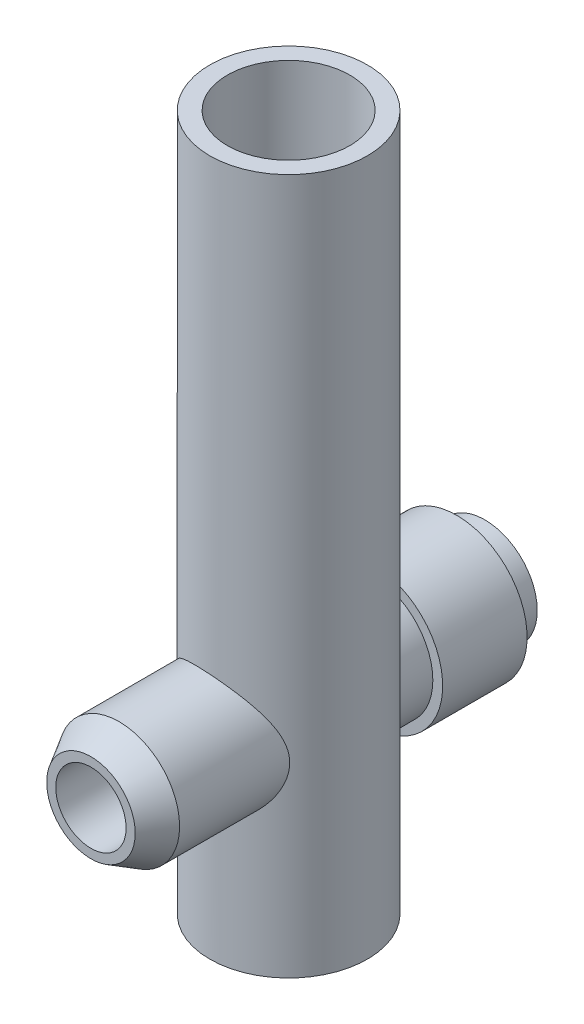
from build123d import *

# Parameters (mm, degrees)
SKETCH1_R           = 4.7244
INSET_DEPTH         = 2.54
SKETCH2_R           = 6.35
BASE_DEPTH          = 7.62
SKETCH3_R           = 5.461
NIB_DEPTH           = 25.4
SKETCH4_R           = 3.175
CUT_EXTRUDE1_DEPTH  = 37.676403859
EXTRUDE1_DEPTH      = 45.974
EXTRUDE1_DEPTH_BACK = 16.8275
SKETCH5_R           = 7.112
SKETCH6_R           = 5.5245
CUT_EXTRUDE2_DEPTH  = 61.214
CHAMFER1_SIZE       = 2.54
CHAMFER1_SIZE2      = 1.466469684


with BuildPart() as part:
    # Sketch1 → inset (new body)
    with BuildSketch(Plane.XY):
        Circle(SKETCH1_R)
    extrude(amount=INSET_DEPTH)

    # Sketch2 → base (add)
    with BuildSketch(Plane.XY.offset(2.54)):
        with Locations(Location((0, 0, 0), (0, 0, 180))):
            Circle(SKETCH2_R)
    extrude(amount=BASE_DEPTH)

    # Sketch3 → nib (add)
    with BuildSketch(Plane.XY.offset(10.16)):
        Circle(SKETCH3_R)
    extrude(amount=NIB_DEPTH)

    # Sketch4 → Cut-Extrude1 (cut, through all)
    with BuildSketch(Plane.XY.offset(35.56)):
        Circle(SKETCH4_R)
    extrude(amount=-CUT_EXTRUDE1_DEPTH, mode=Mode.SUBTRACT)

    # Sketch5 → Extrude1 (add, two sides: drawn at the far end of the back side and taken through both)
    with BuildSketch(Plane(origin=(0, 0, 0), x_dir=(1, 0, 0), z_dir=(0, 1, 0)).offset(-EXTRUDE1_DEPTH_BACK)):
        with Locations(Location((0.381, -18.0975, 0), (0, 0, 270))):
            Circle(SKETCH5_R)
    extrude(amount=EXTRUDE1_DEPTH + EXTRUDE1_DEPTH_BACK)

    # Sketch6 → Cut-Extrude2 (cut)
    with BuildSketch(Plane(origin=(0, 45.974, 0), x_dir=(1, 0, 0), z_dir=(0, 1, 0))):
        with Locations(Location((0.381, -18.0975, 0), (0, 0, 270))):
            Circle(SKETCH6_R)
    extrude(amount=-CUT_EXTRUDE2_DEPTH, mode=Mode.SUBTRACT)

    # Chamfer1
    chamfer1_edges = [part.edges().sort_by_distance(p)[0] for p in [
        (-5.461, 0, 35.56),
    ]]
    chamfer1_side = [part.faces().sort_by_distance(p)[0] for p in [
        (-5.461, 0, 28.856777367),
    ]]
    chamfer(chamfer1_edges, length=CHAMFER1_SIZE, length2=CHAMFER1_SIZE2, reference=chamfer1_side[0])


solid = part.part
